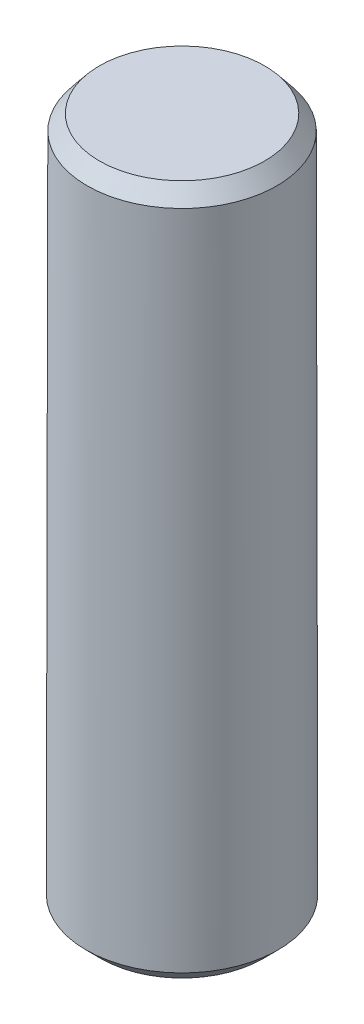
ISO-10303-21;
HEADER;
FILE_DESCRIPTION(('STEP AP214'),'2;1');
FILE_NAME('part.step','',(''),(''),'','','');
FILE_SCHEMA(('AUTOMOTIVE_DESIGN { 1 0 10303 214 1 1 1 1 }'));
ENDSEC;
DATA;
#1=APPLICATION_CONTEXT('core data for automotive mechanical design processes');
#2=APPLICATION_PROTOCOL_DEFINITION('international standard','automotive_design',2000,#1);
#3=PRODUCT_CONTEXT('',#1,'mechanical');
#4=PRODUCT('Part','Part','',(#3));
#5=PRODUCT_RELATED_PRODUCT_CATEGORY('part','',(#4));
#6=PRODUCT_DEFINITION_FORMATION('','',#4);
#7=PRODUCT_DEFINITION_CONTEXT('part definition',#1,'design');
#8=PRODUCT_DEFINITION('design','',#6,#7);
#9=PRODUCT_DEFINITION_SHAPE('','',#8);
#10=(LENGTH_UNIT() NAMED_UNIT(*) SI_UNIT(.MILLI.,.METRE.));
#11=(NAMED_UNIT(*) PLANE_ANGLE_UNIT() SI_UNIT($,.RADIAN.));
#12=(NAMED_UNIT(*) SI_UNIT($,.STERADIAN.) SOLID_ANGLE_UNIT());
#13=UNCERTAINTY_MEASURE_WITH_UNIT(LENGTH_MEASURE(1.E-05),#10,'distance_accuracy_value','');
#14=(GEOMETRIC_REPRESENTATION_CONTEXT(3) GLOBAL_UNCERTAINTY_ASSIGNED_CONTEXT((#13)) GLOBAL_UNIT_ASSIGNED_CONTEXT((#10,
#11,#12)) REPRESENTATION_CONTEXT('',''));
#15=CARTESIAN_POINT('',(0.,0.,0.));
#16=DIRECTION('',(0.,0.,1.));
#17=DIRECTION('',(1.,0.,0.));
#18=AXIS2_PLACEMENT_3D('',#15,#16,#17);
#19=CARTESIAN_POINT('',(0.,0.,0.));
#20=DIRECTION('',(0.,-1.,0.));
#21=DIRECTION('',(0.,0.,1.));
#22=AXIS2_PLACEMENT_3D('',#19,#20,#21);
#23=CONICAL_SURFACE('',#22,3.15,0.0015707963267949);
#24=CARTESIAN_POINT('',(0.,0.4992158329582,0.));
#25=DIRECTION('',(0.,1.,0.));
#26=DIRECTION('',(0.,0.,1.));
#27=AXIS2_PLACEMENT_3D('',#24,#25,#26);
#28=CIRCLE('',#27,3.14921583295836);
#29=CARTESIAN_POINT('',(0.,0.4992158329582,3.14921583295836));
#30=VERTEX_POINT('',#29);
#31=EDGE_CURVE('E41',#30,#30,#28,.T.);
#32=ORIENTED_EDGE('',*,*,#31,.T.);
#33=EDGE_LOOP('',(#32));
#34=FACE_BOUND('',#33,.T.);
#35=CARTESIAN_POINT('',(0.,22.2000006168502,0.));
#36=DIRECTION('',(0.,-1.,0.));
#37=DIRECTION('',(0.,0.,-1.));
#38=AXIS2_PLACEMENT_3D('',#35,#36,#37);
#39=CIRCLE('',#38,3.11512829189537);
#40=CARTESIAN_POINT('',(0.,22.2000006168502,-3.11512829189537));
#41=VERTEX_POINT('',#40);
#42=EDGE_CURVE('E45',#41,#41,#39,.T.);
#43=ORIENTED_EDGE('',*,*,#42,.T.);
#44=EDGE_LOOP('',(#43));
#45=FACE_BOUND('',#44,.T.);
#46=ADVANCED_FACE('F34',(#34,#45),#23,.T.);
#47=CARTESIAN_POINT('',(0.,22.7,0.));
#48=DIRECTION('',(0.,1.,0.));
#49=DIRECTION('',(0.,0.,1.));
#50=AXIS2_PLACEMENT_3D('',#47,#48,#49);
#51=PLANE('',#50);
#52=CARTESIAN_POINT('',(0.,22.7,0.));
#53=DIRECTION('',(0.,1.,0.));
#54=DIRECTION('',(0.,0.,1.));
#55=AXIS2_PLACEMENT_3D('',#52,#53,#54);
#56=CIRCLE('',#55,2.70893469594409);
#57=CARTESIAN_POINT('',(0.,22.7,2.70893469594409));
#58=VERTEX_POINT('',#57);
#59=EDGE_CURVE('E49',#58,#58,#56,.T.);
#60=ORIENTED_EDGE('',*,*,#59,.T.);
#61=EDGE_LOOP('',(#60));
#62=FACE_BOUND('',#61,.T.);
#63=ADVANCED_FACE('F55',(#62),#51,.T.);
#64=CARTESIAN_POINT('',(0.,0.,0.));
#65=DIRECTION('',(0.,1.,0.));
#66=DIRECTION('',(0.,0.,1.));
#67=AXIS2_PLACEMENT_3D('',#64,#65,#66);
#68=PLANE('',#67);
#69=CARTESIAN_POINT('',(0.,0.,0.));
#70=DIRECTION('',(0.,1.,0.));
#71=DIRECTION('',(0.,0.,1.));
#72=AXIS2_PLACEMENT_3D('',#69,#70,#71);
#73=CIRCLE('',#72,2.64999999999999);
#74=CARTESIAN_POINT('',(0.,0.,2.64999999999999));
#75=VERTEX_POINT('',#74);
#76=EDGE_CURVE('E10',#75,#75,#73,.F.);
#77=ORIENTED_EDGE('',*,*,#76,.T.);
#78=EDGE_LOOP('',(#77));
#79=FACE_BOUND('',#78,.T.);
#80=ADVANCED_FACE('F59',(#79),#68,.F.);
#81=CARTESIAN_POINT('',(0.,22.7,0.));
#82=DIRECTION('',(0.,-1.,0.));
#83=DIRECTION('',(0.,0.,-1.));
#84=AXIS2_PLACEMENT_3D('',#81,#82,#83);
#85=CONICAL_SURFACE('',#84,2.70893469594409,0.682249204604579);
#86=ORIENTED_EDGE('',*,*,#42,.F.);
#87=EDGE_LOOP('',(#86));
#88=FACE_BOUND('',#87,.T.);
#89=ORIENTED_EDGE('',*,*,#59,.F.);
#90=EDGE_LOOP('',(#89));
#91=FACE_BOUND('',#90,.T.);
#92=ADVANCED_FACE('F57',(#88,#91),#85,.T.);
#93=CARTESIAN_POINT('',(0.,0.499215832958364,0.));
#94=DIRECTION('',(0.,1.,0.));
#95=DIRECTION('',(0.,0.,1.));
#96=AXIS2_PLACEMENT_3D('',#93,#94,#95);
#97=CONICAL_SURFACE('',#96,3.14921583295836,0.785398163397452);
#98=ORIENTED_EDGE('',*,*,#76,.F.);
#99=EDGE_LOOP('',(#98));
#100=FACE_BOUND('',#99,.T.);
#101=ORIENTED_EDGE('',*,*,#31,.F.);
#102=EDGE_LOOP('',(#101));
#103=FACE_BOUND('',#102,.T.);
#104=ADVANCED_FACE('F36',(#100,#103),#97,.T.);
#105=CLOSED_SHELL('',(#46,#63,#80,#92,#104));
#106=MANIFOLD_SOLID_BREP('B2',#105);
#107=ADVANCED_BREP_SHAPE_REPRESENTATION('',(#18,#106),#14);
#108=SHAPE_DEFINITION_REPRESENTATION(#9,#107);
ENDSEC;
END-ISO-10303-21;
